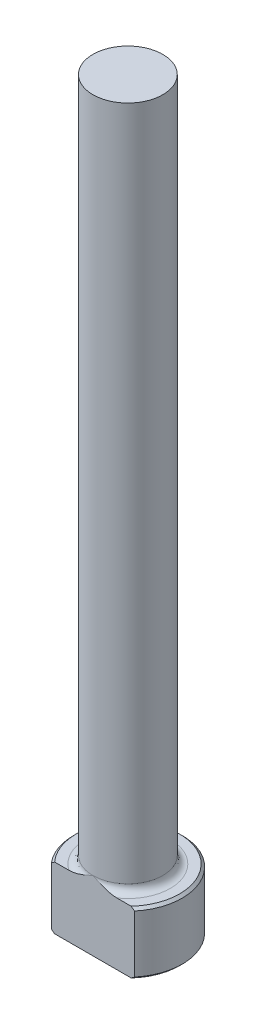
from build123d import *

# Parameters (mm, degrees)
CHAMFER1_SIZE = 0.254
FILLET1_R     = 0.762
KEY_DEPTH     = 77.603151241


with BuildPart() as part:
    # Sketch1 → Revolve1 (revolve)
    with BuildSketch(Plane.XY, mode=Mode.PRIVATE) as revolve1_sk:
        Polygon((0, 0), (-5.5499, 0), (-5.5499, 6.35), (-3.57124, 6.35), (-3.57124, 76.2), (0, 76.2), align=None)
    revolve(revolve1_sk.sketch.rotate(Axis((0, 259.958771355, 0), (0, -1, 0)), 270), axis=Axis((0, 259.958771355, 0), (0, -1, 0)))

    # Chamfer1
    chamfer1_edges = [part.edges().sort_by_distance(p)[0] for p in [
        (0, 6.35, -5.5499),
        (0, 0, -5.5499),
    ]]
    chamfer(chamfer1_edges, length=CHAMFER1_SIZE)

    # Fillet1
    fillet1_edges = [part.edges().sort_by_distance(p)[0] for p in [
        (0, 6.35, -3.57124),
    ]]
    fillet(fillet1_edges, radius=FILLET1_R)

    # Sketch2 → Key (cut, through all)
    with BuildSketch(Plane(origin=(0, 0, 0), x_dir=(1, 0, 0), z_dir=(0, 1, 0))):
        with BuildLine():
            Line((-4.248250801, -3.57124), (4.248250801, -3.57124))
            ThreePointArc((4.248250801, -3.57124), (0, -5.5499), (-4.248250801, -3.57124))
        make_face()
    extrude(amount=KEY_DEPTH, mode=Mode.SUBTRACT)


solid = part.part
